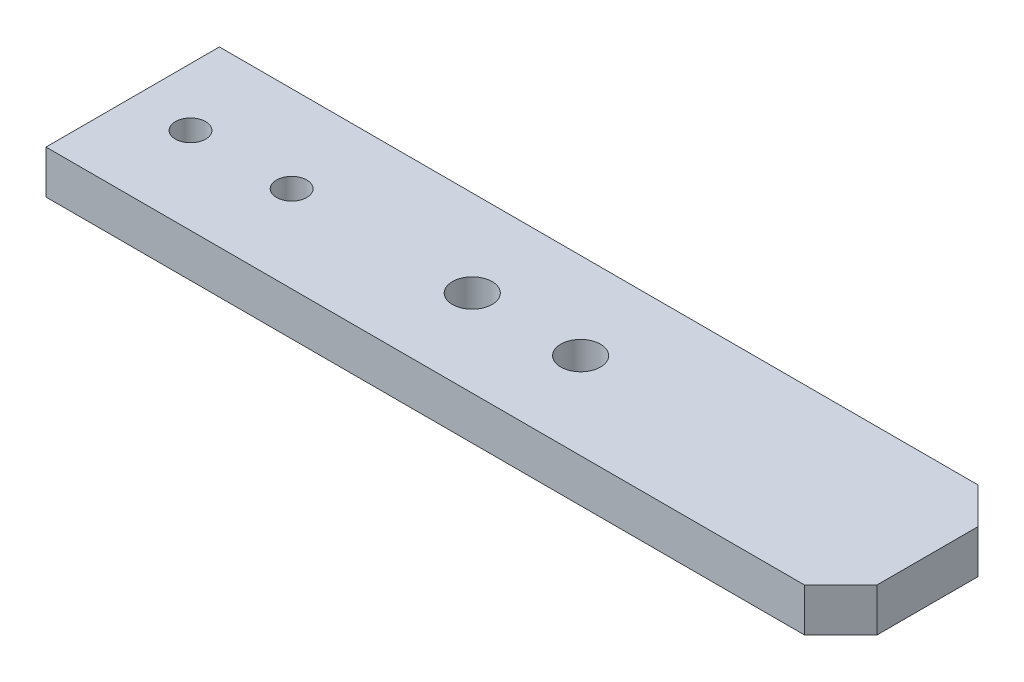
ISO-10303-21;
HEADER;
FILE_DESCRIPTION(('STEP AP214'),'2;1');
FILE_NAME('part.step','',(''),(''),'','','');
FILE_SCHEMA(('AUTOMOTIVE_DESIGN { 1 0 10303 214 1 1 1 1 }'));
ENDSEC;
DATA;
#1=APPLICATION_CONTEXT('core data for automotive mechanical design processes');
#2=APPLICATION_PROTOCOL_DEFINITION('international standard','automotive_design',2000,#1);
#3=PRODUCT_CONTEXT('',#1,'mechanical');
#4=PRODUCT('Part','Part','',(#3));
#5=PRODUCT_RELATED_PRODUCT_CATEGORY('part','',(#4));
#6=PRODUCT_DEFINITION_FORMATION('','',#4);
#7=PRODUCT_DEFINITION_CONTEXT('part definition',#1,'design');
#8=PRODUCT_DEFINITION('design','',#6,#7);
#9=PRODUCT_DEFINITION_SHAPE('','',#8);
#10=(LENGTH_UNIT() NAMED_UNIT(*) SI_UNIT(.MILLI.,.METRE.));
#11=(NAMED_UNIT(*) PLANE_ANGLE_UNIT() SI_UNIT($,.RADIAN.));
#12=(NAMED_UNIT(*) SI_UNIT($,.STERADIAN.) SOLID_ANGLE_UNIT());
#13=UNCERTAINTY_MEASURE_WITH_UNIT(LENGTH_MEASURE(1.E-05),#10,'distance_accuracy_value','');
#14=(GEOMETRIC_REPRESENTATION_CONTEXT(3) GLOBAL_UNCERTAINTY_ASSIGNED_CONTEXT((#13)) GLOBAL_UNIT_ASSIGNED_CONTEXT((#10,
#11,#12)) REPRESENTATION_CONTEXT('',''));
#15=CARTESIAN_POINT('',(0.,0.,0.));
#16=DIRECTION('',(0.,0.,1.));
#17=DIRECTION('',(1.,0.,0.));
#18=AXIS2_PLACEMENT_3D('',#15,#16,#17);
#19=CARTESIAN_POINT('',(0.,6.,-24.));
#20=DIRECTION('',(0.,-1.,0.));
#21=DIRECTION('',(0.,0.,-1.));
#22=AXIS2_PLACEMENT_3D('',#19,#20,#21);
#23=PLANE('',#22);
#24=CARTESIAN_POINT('',(22.,6.,-12.));
#25=DIRECTION('',(0.,1.,0.));
#26=DIRECTION('',(0.,0.,1.));
#27=AXIS2_PLACEMENT_3D('',#24,#25,#26);
#28=CIRCLE('',#27,2.09999999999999);
#29=CARTESIAN_POINT('',(22.,6.,-9.90000000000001));
#30=VERTEX_POINT('',#29);
#31=EDGE_CURVE('E185',#30,#30,#28,.T.);
#32=ORIENTED_EDGE('',*,*,#31,.F.);
#33=EDGE_LOOP('',(#32));
#34=FACE_BOUND('',#33,.T.);
#35=CARTESIAN_POINT('',(47.,6.,-12.));
#36=DIRECTION('',(0.,1.,0.));
#37=DIRECTION('',(0.,0.,1.));
#38=AXIS2_PLACEMENT_3D('',#35,#36,#37);
#39=CIRCLE('',#38,2.75);
#40=CARTESIAN_POINT('',(47.,6.,-9.25));
#41=VERTEX_POINT('',#40);
#42=EDGE_CURVE('E120',#41,#41,#39,.T.);
#43=ORIENTED_EDGE('',*,*,#42,.F.);
#44=EDGE_LOOP('',(#43));
#45=FACE_BOUND('',#44,.T.);
#46=DIRECTION('',(0.,0.,1.));
#47=VECTOR('',#46,1.);
#48=CARTESIAN_POINT('',(0.,6.,0.));
#49=LINE('',#48,#47);
#50=CARTESIAN_POINT('',(0.,6.,-24.));
#51=VERTEX_POINT('',#50);
#52=CARTESIAN_POINT('',(0.,6.,0.));
#53=VERTEX_POINT('',#52);
#54=EDGE_CURVE('E127',#51,#53,#49,.T.);
#55=ORIENTED_EDGE('',*,*,#54,.T.);
#56=DIRECTION('',(1.,0.,0.));
#57=VECTOR('',#56,1.);
#58=CARTESIAN_POINT('',(0.,6.,0.));
#59=LINE('',#58,#57);
#60=CARTESIAN_POINT('',(105.,6.,0.));
#61=VERTEX_POINT('',#60);
#62=EDGE_CURVE('E85',#53,#61,#59,.T.);
#63=ORIENTED_EDGE('',*,*,#62,.T.);
#64=DIRECTION('',(0.707106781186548,0.,-0.707106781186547));
#65=VECTOR('',#64,1.);
#66=CARTESIAN_POINT('',(105.,6.,0.));
#67=LINE('',#66,#65);
#68=CARTESIAN_POINT('',(110.,6.,-5.));
#69=VERTEX_POINT('',#68);
#70=EDGE_CURVE('E98',#61,#69,#67,.T.);
#71=ORIENTED_EDGE('',*,*,#70,.T.);
#72=DIRECTION('',(0.,0.,-1.));
#73=VECTOR('',#72,1.);
#74=CARTESIAN_POINT('',(110.,6.,-5.));
#75=LINE('',#74,#73);
#76=CARTESIAN_POINT('',(110.,6.,-19.));
#77=VERTEX_POINT('',#76);
#78=EDGE_CURVE('E92',#69,#77,#75,.T.);
#79=ORIENTED_EDGE('',*,*,#78,.T.);
#80=DIRECTION('',(-0.707106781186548,0.,-0.707106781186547));
#81=VECTOR('',#80,1.);
#82=CARTESIAN_POINT('',(105.,6.,-24.));
#83=LINE('',#82,#81);
#84=CARTESIAN_POINT('',(105.,6.,-24.));
#85=VERTEX_POINT('',#84);
#86=EDGE_CURVE('E96',#77,#85,#83,.T.);
#87=ORIENTED_EDGE('',*,*,#86,.T.);
#88=DIRECTION('',(-1.,0.,0.));
#89=VECTOR('',#88,1.);
#90=CARTESIAN_POINT('',(0.,6.,-24.));
#91=LINE('',#90,#89);
#92=EDGE_CURVE('E48',#85,#51,#91,.T.);
#93=ORIENTED_EDGE('',*,*,#92,.T.);
#94=EDGE_LOOP('',(#55,#63,#71,#79,#87,#93));
#95=FACE_BOUND('',#94,.T.);
#96=CARTESIAN_POINT('',(62.,6.,-12.));
#97=DIRECTION('',(0.,1.,0.));
#98=DIRECTION('',(0.,0.,1.));
#99=AXIS2_PLACEMENT_3D('',#96,#97,#98);
#100=CIRCLE('',#99,2.75000000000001);
#101=CARTESIAN_POINT('',(62.,6.,-9.24999999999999));
#102=VERTEX_POINT('',#101);
#103=EDGE_CURVE('E194',#102,#102,#100,.T.);
#104=ORIENTED_EDGE('',*,*,#103,.F.);
#105=EDGE_LOOP('',(#104));
#106=FACE_BOUND('',#105,.T.);
#107=CARTESIAN_POINT('',(8.,6.,-12.));
#108=DIRECTION('',(0.,1.,0.));
#109=DIRECTION('',(0.,0.,1.));
#110=AXIS2_PLACEMENT_3D('',#107,#108,#109);
#111=CIRCLE('',#110,2.09999999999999);
#112=CARTESIAN_POINT('',(8.,6.,-9.90000000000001));
#113=VERTEX_POINT('',#112);
#114=EDGE_CURVE('E182',#113,#113,#111,.T.);
#115=ORIENTED_EDGE('',*,*,#114,.F.);
#116=EDGE_LOOP('',(#115));
#117=FACE_BOUND('',#116,.T.);
#118=ADVANCED_FACE('F31',(#34,#45,#95,#106,#117),#23,.F.);
#119=CARTESIAN_POINT('',(0.,0.,-24.));
#120=DIRECTION('',(0.,-1.,0.));
#121=DIRECTION('',(0.,0.,-1.));
#122=AXIS2_PLACEMENT_3D('',#119,#120,#121);
#123=PLANE('',#122);
#124=CARTESIAN_POINT('',(8.,0.,-12.));
#125=DIRECTION('',(0.,1.,0.));
#126=DIRECTION('',(0.,0.,1.));
#127=AXIS2_PLACEMENT_3D('',#124,#125,#126);
#128=CIRCLE('',#127,2.1);
#129=CARTESIAN_POINT('',(8.,0.,-9.9));
#130=VERTEX_POINT('',#129);
#131=EDGE_CURVE('E179',#130,#130,#128,.T.);
#132=ORIENTED_EDGE('',*,*,#131,.T.);
#133=EDGE_LOOP('',(#132));
#134=FACE_BOUND('',#133,.T.);
#135=CARTESIAN_POINT('',(22.,0.,-12.));
#136=DIRECTION('',(0.,1.,0.));
#137=DIRECTION('',(0.,0.,1.));
#138=AXIS2_PLACEMENT_3D('',#135,#136,#137);
#139=CIRCLE('',#138,2.1);
#140=CARTESIAN_POINT('',(22.,0.,-9.9));
#141=VERTEX_POINT('',#140);
#142=EDGE_CURVE('E190',#141,#141,#139,.T.);
#143=ORIENTED_EDGE('',*,*,#142,.T.);
#144=EDGE_LOOP('',(#143));
#145=FACE_BOUND('',#144,.T.);
#146=CARTESIAN_POINT('',(47.,0.,-12.));
#147=DIRECTION('',(0.,1.,0.));
#148=DIRECTION('',(0.,0.,1.));
#149=AXIS2_PLACEMENT_3D('',#146,#147,#148);
#150=CIRCLE('',#149,2.75);
#151=CARTESIAN_POINT('',(47.,0.,-9.25));
#152=VERTEX_POINT('',#151);
#153=EDGE_CURVE('E197',#152,#152,#150,.T.);
#154=ORIENTED_EDGE('',*,*,#153,.T.);
#155=EDGE_LOOP('',(#154));
#156=FACE_BOUND('',#155,.T.);
#157=DIRECTION('',(0.,0.,1.));
#158=VECTOR('',#157,1.);
#159=CARTESIAN_POINT('',(0.,0.,0.));
#160=LINE('',#159,#158);
#161=CARTESIAN_POINT('',(0.,0.,-24.));
#162=VERTEX_POINT('',#161);
#163=CARTESIAN_POINT('',(0.,0.,0.));
#164=VERTEX_POINT('',#163);
#165=EDGE_CURVE('E116',#162,#164,#160,.T.);
#166=ORIENTED_EDGE('',*,*,#165,.F.);
#167=DIRECTION('',(-1.,0.,0.));
#168=VECTOR('',#167,1.);
#169=CARTESIAN_POINT('',(0.,0.,-24.));
#170=LINE('',#169,#168);
#171=CARTESIAN_POINT('',(105.,0.,-24.));
#172=VERTEX_POINT('',#171);
#173=EDGE_CURVE('E77',#172,#162,#170,.T.);
#174=ORIENTED_EDGE('',*,*,#173,.F.);
#175=DIRECTION('',(-0.707106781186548,0.,-0.707106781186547));
#176=VECTOR('',#175,1.);
#177=CARTESIAN_POINT('',(105.,0.,-24.));
#178=LINE('',#177,#176);
#179=CARTESIAN_POINT('',(110.,0.,-19.));
#180=VERTEX_POINT('',#179);
#181=EDGE_CURVE('E71',#180,#172,#178,.T.);
#182=ORIENTED_EDGE('',*,*,#181,.F.);
#183=DIRECTION('',(0.,0.,-1.));
#184=VECTOR('',#183,1.);
#185=CARTESIAN_POINT('',(110.,0.,-5.));
#186=LINE('',#185,#184);
#187=CARTESIAN_POINT('',(110.,0.,-5.));
#188=VERTEX_POINT('',#187);
#189=EDGE_CURVE('E106',#188,#180,#186,.T.);
#190=ORIENTED_EDGE('',*,*,#189,.F.);
#191=DIRECTION('',(0.707106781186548,0.,-0.707106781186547));
#192=VECTOR('',#191,1.);
#193=CARTESIAN_POINT('',(105.,0.,0.));
#194=LINE('',#193,#192);
#195=CARTESIAN_POINT('',(105.,0.,0.));
#196=VERTEX_POINT('',#195);
#197=EDGE_CURVE('E122',#196,#188,#194,.T.);
#198=ORIENTED_EDGE('',*,*,#197,.F.);
#199=DIRECTION('',(1.,0.,0.));
#200=VECTOR('',#199,1.);
#201=CARTESIAN_POINT('',(0.,0.,0.));
#202=LINE('',#201,#200);
#203=EDGE_CURVE('E119',#164,#196,#202,.T.);
#204=ORIENTED_EDGE('',*,*,#203,.F.);
#205=EDGE_LOOP('',(#166,#174,#182,#190,#198,#204));
#206=FACE_BOUND('',#205,.T.);
#207=CARTESIAN_POINT('',(62.,0.,-12.));
#208=DIRECTION('',(0.,1.,0.));
#209=DIRECTION('',(0.,0.,1.));
#210=AXIS2_PLACEMENT_3D('',#207,#208,#209);
#211=CIRCLE('',#210,2.75000000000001);
#212=CARTESIAN_POINT('',(62.,0.,-9.24999999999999));
#213=VERTEX_POINT('',#212);
#214=EDGE_CURVE('E193',#213,#213,#211,.T.);
#215=ORIENTED_EDGE('',*,*,#214,.T.);
#216=EDGE_LOOP('',(#215));
#217=FACE_BOUND('',#216,.T.);
#218=ADVANCED_FACE('F136',(#134,#145,#156,#206,#217),#123,.T.);
#219=CARTESIAN_POINT('',(0.,6.,0.));
#220=DIRECTION('',(1.,0.,0.));
#221=DIRECTION('',(0.,0.,-1.));
#222=AXIS2_PLACEMENT_3D('',#219,#220,#221);
#223=PLANE('',#222);
#224=ORIENTED_EDGE('',*,*,#165,.T.);
#225=DIRECTION('',(0.,-1.,0.));
#226=VECTOR('',#225,1.);
#227=CARTESIAN_POINT('',(0.,6.,0.));
#228=LINE('',#227,#226);
#229=EDGE_CURVE('E11',#53,#164,#228,.T.);
#230=ORIENTED_EDGE('',*,*,#229,.F.);
#231=ORIENTED_EDGE('',*,*,#54,.F.);
#232=DIRECTION('',(0.,-1.,0.));
#233=VECTOR('',#232,1.);
#234=CARTESIAN_POINT('',(0.,6.,-24.));
#235=LINE('',#234,#233);
#236=EDGE_CURVE('E112',#51,#162,#235,.T.);
#237=ORIENTED_EDGE('',*,*,#236,.T.);
#238=EDGE_LOOP('',(#224,#230,#231,#237));
#239=FACE_BOUND('',#238,.T.);
#240=ADVANCED_FACE('F33',(#239),#223,.F.);
#241=CARTESIAN_POINT('',(0.,6.,0.));
#242=DIRECTION('',(0.,0.,-1.));
#243=DIRECTION('',(-1.,0.,0.));
#244=AXIS2_PLACEMENT_3D('',#241,#242,#243);
#245=PLANE('',#244);
#246=ORIENTED_EDGE('',*,*,#203,.T.);
#247=DIRECTION('',(0.,-1.,0.));
#248=VECTOR('',#247,1.);
#249=CARTESIAN_POINT('',(105.,6.,0.));
#250=LINE('',#249,#248);
#251=EDGE_CURVE('E40',#61,#196,#250,.T.);
#252=ORIENTED_EDGE('',*,*,#251,.F.);
#253=ORIENTED_EDGE('',*,*,#62,.F.);
#254=ORIENTED_EDGE('',*,*,#229,.T.);
#255=EDGE_LOOP('',(#246,#252,#253,#254));
#256=FACE_BOUND('',#255,.T.);
#257=ADVANCED_FACE('F255',(#256),#245,.F.);
#258=CARTESIAN_POINT('',(105.,6.,0.));
#259=DIRECTION('',(-0.707106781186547,0.,-0.707106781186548));
#260=DIRECTION('',(-0.707106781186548,0.,0.707106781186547));
#261=AXIS2_PLACEMENT_3D('',#258,#259,#260);
#262=PLANE('',#261);
#263=ORIENTED_EDGE('',*,*,#197,.T.);
#264=DIRECTION('',(0.,-1.,0.));
#265=VECTOR('',#264,1.);
#266=CARTESIAN_POINT('',(110.,6.,-5.));
#267=LINE('',#266,#265);
#268=EDGE_CURVE('E107',#69,#188,#267,.T.);
#269=ORIENTED_EDGE('',*,*,#268,.F.);
#270=ORIENTED_EDGE('',*,*,#70,.F.);
#271=ORIENTED_EDGE('',*,*,#251,.T.);
#272=EDGE_LOOP('',(#263,#269,#270,#271));
#273=FACE_BOUND('',#272,.T.);
#274=ADVANCED_FACE('F133',(#273),#262,.F.);
#275=CARTESIAN_POINT('',(110.,6.,-5.));
#276=DIRECTION('',(-1.,0.,0.));
#277=DIRECTION('',(0.,0.,1.));
#278=AXIS2_PLACEMENT_3D('',#275,#276,#277);
#279=PLANE('',#278);
#280=ORIENTED_EDGE('',*,*,#189,.T.);
#281=DIRECTION('',(0.,-1.,0.));
#282=VECTOR('',#281,1.);
#283=CARTESIAN_POINT('',(110.,6.,-19.));
#284=LINE('',#283,#282);
#285=EDGE_CURVE('E103',#77,#180,#284,.T.);
#286=ORIENTED_EDGE('',*,*,#285,.F.);
#287=ORIENTED_EDGE('',*,*,#78,.F.);
#288=ORIENTED_EDGE('',*,*,#268,.T.);
#289=EDGE_LOOP('',(#280,#286,#287,#288));
#290=FACE_BOUND('',#289,.T.);
#291=ADVANCED_FACE('F104',(#290),#279,.F.);
#292=CARTESIAN_POINT('',(105.,6.,-24.));
#293=DIRECTION('',(-0.707106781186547,0.,0.707106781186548));
#294=DIRECTION('',(0.707106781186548,0.,0.707106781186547));
#295=AXIS2_PLACEMENT_3D('',#292,#293,#294);
#296=PLANE('',#295);
#297=ORIENTED_EDGE('',*,*,#181,.T.);
#298=DIRECTION('',(0.,-1.,0.));
#299=VECTOR('',#298,1.);
#300=CARTESIAN_POINT('',(105.,6.,-24.));
#301=LINE('',#300,#299);
#302=EDGE_CURVE('E108',#85,#172,#301,.T.);
#303=ORIENTED_EDGE('',*,*,#302,.F.);
#304=ORIENTED_EDGE('',*,*,#86,.F.);
#305=ORIENTED_EDGE('',*,*,#285,.T.);
#306=EDGE_LOOP('',(#297,#303,#304,#305));
#307=FACE_BOUND('',#306,.T.);
#308=ADVANCED_FACE('F110',(#307),#296,.F.);
#309=CARTESIAN_POINT('',(0.,6.,-24.));
#310=DIRECTION('',(0.,0.,1.));
#311=DIRECTION('',(1.,0.,0.));
#312=AXIS2_PLACEMENT_3D('',#309,#310,#311);
#313=PLANE('',#312);
#314=ORIENTED_EDGE('',*,*,#173,.T.);
#315=ORIENTED_EDGE('',*,*,#236,.F.);
#316=ORIENTED_EDGE('',*,*,#92,.F.);
#317=ORIENTED_EDGE('',*,*,#302,.T.);
#318=EDGE_LOOP('',(#314,#315,#316,#317));
#319=FACE_BOUND('',#318,.T.);
#320=ADVANCED_FACE('F141',(#319),#313,.F.);
#321=CARTESIAN_POINT('',(47.,6.,-12.));
#322=DIRECTION('',(0.,-1.,0.));
#323=DIRECTION('',(0.,0.,-1.));
#324=AXIS2_PLACEMENT_3D('',#321,#322,#323);
#325=CYLINDRICAL_SURFACE('',#324,2.75);
#326=ORIENTED_EDGE('',*,*,#42,.T.);
#327=EDGE_LOOP('',(#326));
#328=FACE_BOUND('',#327,.T.);
#329=ORIENTED_EDGE('',*,*,#153,.F.);
#330=EDGE_LOOP('',(#329));
#331=FACE_BOUND('',#330,.T.);
#332=ADVANCED_FACE('F143',(#328,#331),#325,.F.);
#333=CARTESIAN_POINT('',(62.,6.,-12.));
#334=DIRECTION('',(0.,-1.,0.));
#335=DIRECTION('',(0.,0.,-1.));
#336=AXIS2_PLACEMENT_3D('',#333,#334,#335);
#337=CYLINDRICAL_SURFACE('',#336,2.75000000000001);
#338=ORIENTED_EDGE('',*,*,#103,.T.);
#339=EDGE_LOOP('',(#338));
#340=FACE_BOUND('',#339,.T.);
#341=ORIENTED_EDGE('',*,*,#214,.F.);
#342=EDGE_LOOP('',(#341));
#343=FACE_BOUND('',#342,.T.);
#344=ADVANCED_FACE('F149',(#340,#343),#337,.F.);
#345=CARTESIAN_POINT('',(22.,6.,-12.));
#346=DIRECTION('',(0.,1.,0.));
#347=DIRECTION('',(0.,0.,1.));
#348=AXIS2_PLACEMENT_3D('',#345,#346,#347);
#349=CYLINDRICAL_SURFACE('',#348,2.09999999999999);
#350=ORIENTED_EDGE('',*,*,#142,.F.);
#351=EDGE_LOOP('',(#350));
#352=FACE_BOUND('',#351,.T.);
#353=ORIENTED_EDGE('',*,*,#31,.T.);
#354=EDGE_LOOP('',(#353));
#355=FACE_BOUND('',#354,.T.);
#356=ADVANCED_FACE('F166',(#352,#355),#349,.F.);
#357=CARTESIAN_POINT('',(8.,6.,-12.));
#358=DIRECTION('',(0.,1.,0.));
#359=DIRECTION('',(0.,0.,1.));
#360=AXIS2_PLACEMENT_3D('',#357,#358,#359);
#361=CYLINDRICAL_SURFACE('',#360,2.09999999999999);
#362=ORIENTED_EDGE('',*,*,#131,.F.);
#363=EDGE_LOOP('',(#362));
#364=FACE_BOUND('',#363,.T.);
#365=ORIENTED_EDGE('',*,*,#114,.T.);
#366=EDGE_LOOP('',(#365));
#367=FACE_BOUND('',#366,.T.);
#368=ADVANCED_FACE('F170',(#364,#367),#361,.F.);
#369=CLOSED_SHELL('',(#118,#218,#240,#257,#274,#291,#308,#320,#332,#344,#356,#368));
#370=MANIFOLD_SOLID_BREP('B2',#369);
#371=ADVANCED_BREP_SHAPE_REPRESENTATION('',(#18,#370),#14);
#372=SHAPE_DEFINITION_REPRESENTATION(#9,#371);
ENDSEC;
END-ISO-10303-21;
